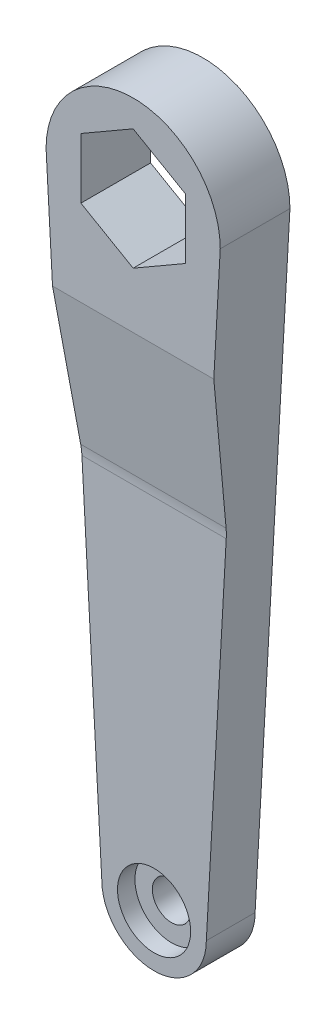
from build123d import *

# Parameters (mm, degrees)
ESQUISSE1_R                  = 2.75
BOSS_EXTRU_1_DEPTH           = 10
ENL_V_MAT_EXTRU_1_DEPTH      = 99.805364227
ENL_V_MAT_EXTRU_1_DEPTH_BACK = 99.805364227
CONG_1_R                     = 10
ESQUISSE4_R                  = 5.25
ENL_V_MAT_EXTRU_3_DEPTH      = 2.5


with BuildPart() as part:
    # Esquisse1 → Boss.-Extru.1 (new body)
    with BuildSketch(Plane.XY):
        with BuildLine():
            Line((-12.5, 0), (-7.5, -90))
            ThreePointArc((-7.5, -90), (0, -97.5), (7.5, -90))
            Line((7.5, -90), (12.5, 0))
            ThreePointArc((12.5, 0), (0, 12.5), (-12.5, 0))
        make_face()
        with Locations((0, -90)):
            Circle(ESQUISSE1_R, mode=Mode.SUBTRACT)
        Polygon((7.5, 4.330127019), (0, 8.660254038), (-7.5, 4.330127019), (-7.5, -4.330127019), (0, -8.660254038), (7.5, -4.330127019), align=None, mode=Mode.SUBTRACT)
    extrude(amount=BOSS_EXTRU_1_DEPTH)

    # Esquisse2 → Enl_v. mat.-Extru.1 (cut, two sides: drawn at the far end of the back side and taken through both)
    with BuildSketch(Plane(origin=(0, 0, 0), x_dir=(0, 0, -1), z_dir=(1, 0, 0)).offset(-ENL_V_MAT_EXTRU_1_DEPTH_BACK)):
        Polygon((-7, -117.10202119), (-7, -37.902502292), (-11.986449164, -2.59593173), (-24.58197059, -2.59593173), (-24.58197059, -117.10202119), align=None)
    extrude(amount=ENL_V_MAT_EXTRU_1_DEPTH + ENL_V_MAT_EXTRU_1_DEPTH_BACK, mode=Mode.SUBTRACT)

    # Cong_1
    cong_1_edges = [part.edges().sort_by_distance(p)[0] for p in [
        (0, -37.902502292, 7),
    ]]
    fillet(cong_1_edges, radius=CONG_1_R)

    # Esquisse4 → Enl_v. mat.-Extru.3 (cut)
    with BuildSketch(Plane.XY.offset(7)):
        with Locations((0, -90)):
            Circle(ESQUISSE4_R)
    extrude(amount=-ENL_V_MAT_EXTRU_3_DEPTH, mode=Mode.SUBTRACT)


solid = part.part
